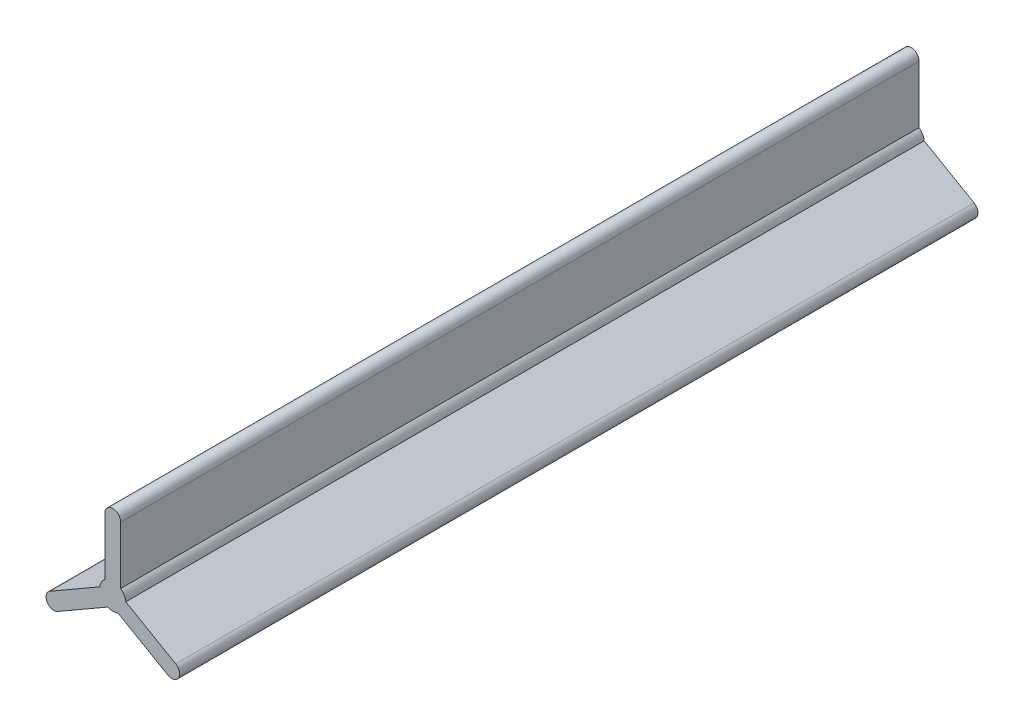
from build123d import *

# Parameters (mm, degrees)
SKETCH3_R           = 10
BOSS_EXTRUDE2_DEPTH = 305
BOSS_EXTRUDE3_DEPTH = 305
CIRPATTERN1_COUNT   = 3


with BuildPart() as part:
    # Sketch3 → Boss-Extrude2 (new, symmetric)
    with BuildSketch(Plane.XY):
        Circle(SKETCH3_R)
    extrude(amount=BOSS_EXTRUDE2_DEPTH, both=True)

    # Sketch4 → Boss-Extrude3 (add, symmetric)
    with BuildSketch(Plane.XY):
        with BuildLine():
            Line((-6, 52), (-6, 8))
            Line((-6, 8), (6, 8))
            Line((6, 8), (6, 52))
            ThreePointArc((6, 52), (0, 58), (-6, 52))
        make_face()
    boss_extrude3 = extrude(amount=BOSS_EXTRUDE3_DEPTH, both=True)

    # CirPattern1: Boss-Extrude3 ×3 about axis
    cirpattern1_axis = Axis((0, 0, 0), (0, 0, 1))
    for i in range(1, CIRPATTERN1_COUNT):
        add(boss_extrude3.rotate(cirpattern1_axis, i * 360 / CIRPATTERN1_COUNT))


solid = part.part
